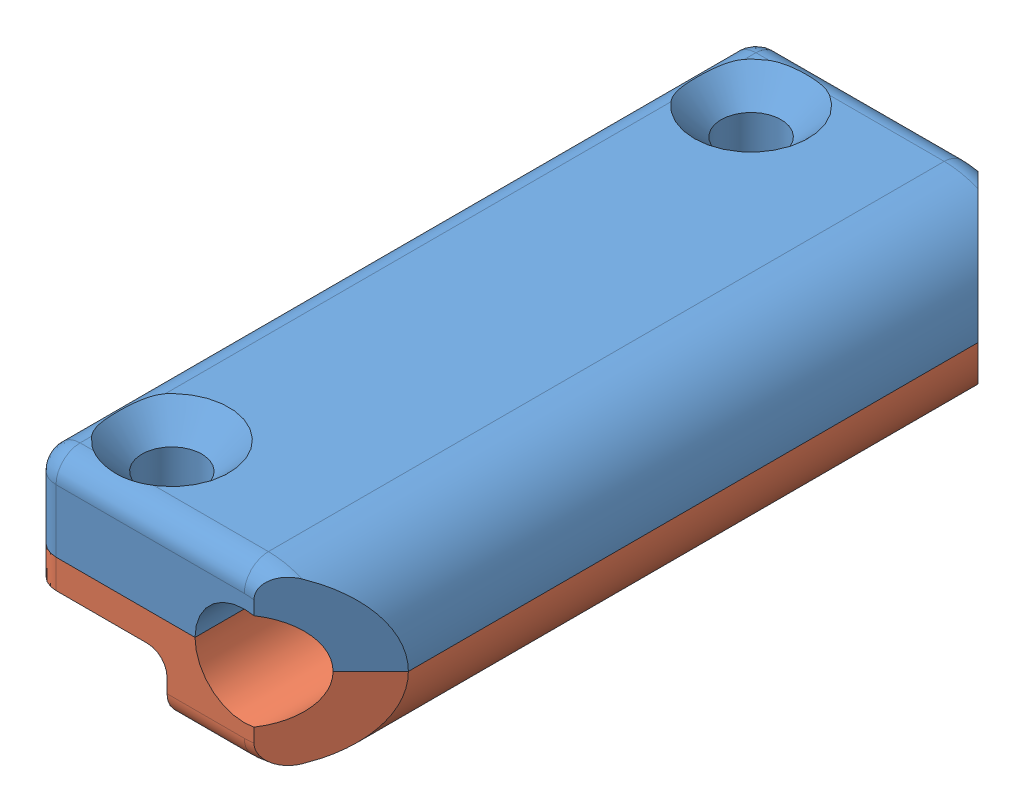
SolidWorks assembly 4635005611_Articulation_Crurale.sldasm, configuration Défaut (file format 13000). Lengths in mm.
Overall size (31 18 75.46).
2 component instances, 2 part files, 0 mates.
Components (placement in the parent):
- 4635005611_2-1: 4635005611_2.SLDPRT [Défaut] at origin size (31 9 75.38)
- 4635005611_1-1: 4635005611_1.SLDPRT [Défaut] at (31 0 0) x (-1 0 0) z (0 0 1) size (31 12.4 75.46)
